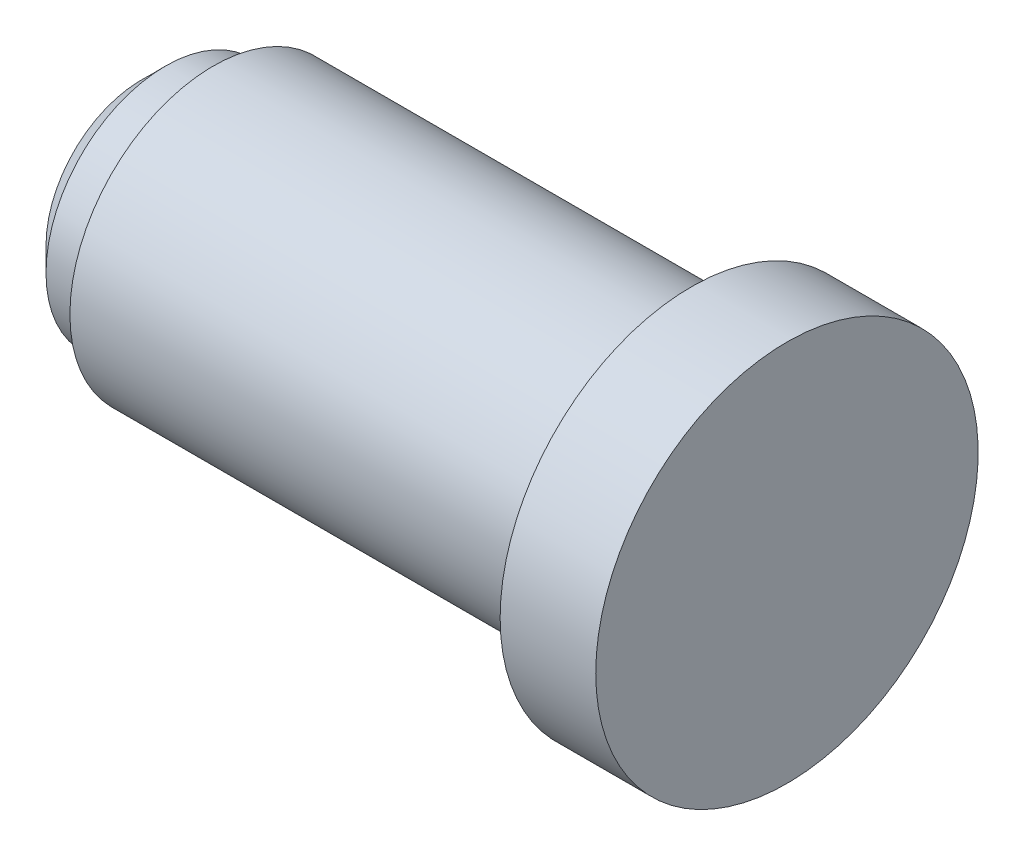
from build123d import *


with BuildPart() as part:
    # Esquisse1 → R_volution1 (revolve)
    with BuildSketch(Plane.XY, mode=Mode.PRIVATE) as r_volution1_sk:
        Polygon((-45.198104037, 0), (-31.698104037, 0), (-31.698104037, 4), (-33.698104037, 4), (-33.698104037, 3), (-43.698104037, 3), (-43.698104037, 2.5), (-44.698104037, 2.5), (-45.198104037, 2), align=None)
    revolve(r_volution1_sk.sketch.rotate(Axis((-45.198104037, 0, 0), (1, 0, 0)), 90), axis=Axis((-45.198104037, 0, 0), (1, 0, 0)))


solid = part.part
